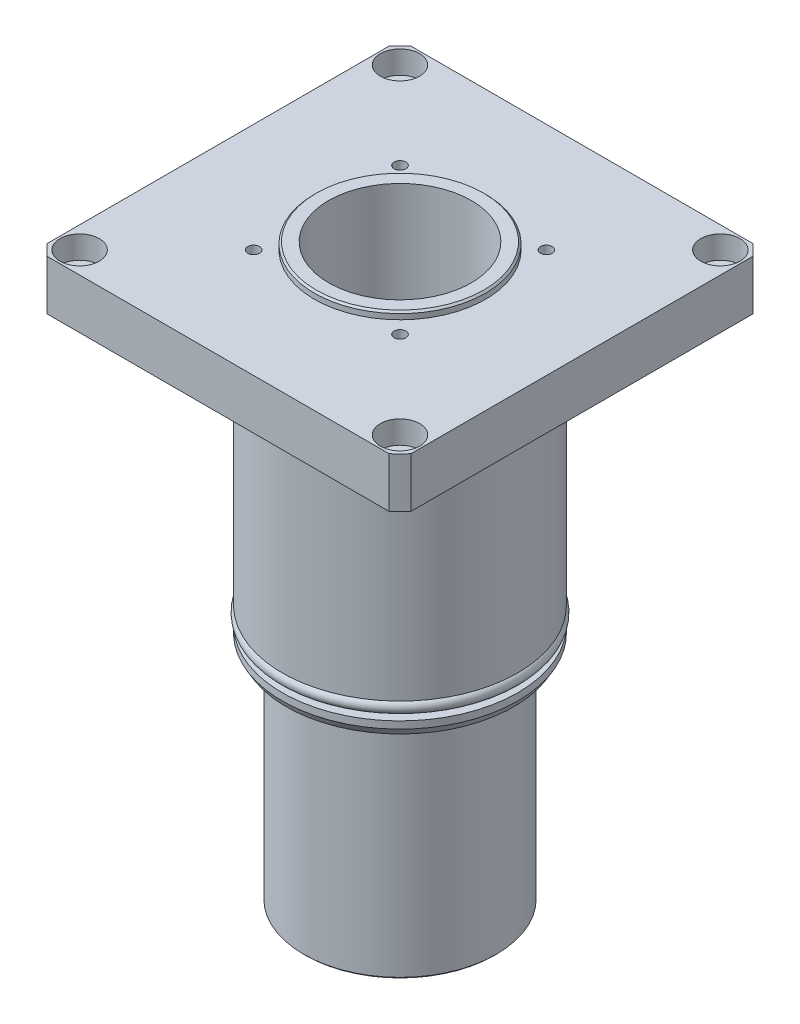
from build123d import *

# Parameters (mm, degrees)
ESQUISSE3_R                                = 1.765
CHANFREIN1_SIZE                            = 0.5
ESQUISSE10_OUTSIDE_W                       = 192.912
ESQUISSE10_OUTSIDE_H                       = 192.912
ESQUISSE10_OUTSIDE_W_2                     = 102
ESQUISSE10_OUTSIDE_H_2                     = 102
ENL_V_MAT_EXTRU_1_DEPTH                    = 30
CHAMBRAGE_POUR_VIS_T_TE_HEXAGONALE_2_COUNT = 2
CHAMBRAGE_POUR_VIS_T_TE_HEXAGONALE_2_PITCH = 89.802561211
CHAMBRAGE_POUR_VIS_T_TE_HEXAGONALE_3_COUNT = 2
CHAMBRAGE_POUR_VIS_T_TE_HEXAGONALE_3_PITCH = 127
CHAMBRAGE_POUR_VIS_T_TE_HEXAGONALE_4_COUNT = 2
CHAMBRAGE_POUR_VIS_T_TE_HEXAGONALE_4_PITCH = 89.802561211
CHANFREIN2_SIZE                            = 0.5
R_P_TITION_CIRCULAIRE1_COUNT               = 4


with BuildPart() as part:
    # Esquisse1 → R_volution1 (revolve)
    with BuildSketch(Plane.XY, mode=Mode.PRIVATE) as r_volution1_sk:
        Polygon((20, 97), (20, -60.802018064), (20.8, -63), (27, -63), (27, 0), (31.845299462, 0), (33, 2), (33, 4), (30, 4), (30, 8.8), (33, 8.8), (33, 65.370834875), (36.25, 71), (36.25, 81), (70, 81), (70, 95), (24, 95), (24, 97), align=None)
    revolve(r_volution1_sk.sketch.rotate(Axis((0, 129.496151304, 0), (0, -1, 0)), 180), axis=Axis((0, 129.496151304, 0), (0, -1, 0)))

    # Chanfrein1
    chanfrein1_edges = [part.edges().sort_by_distance(p)[0] for p in [
        (27, -63, 0),
    ]]
    chamfer(chanfrein1_edges, length=CHANFREIN1_SIZE)

    # Esquisse10 outside → Enl_v. mat.-Extru.1 (cut)
    with BuildSketch(Plane(origin=(0, 95, 0), x_dir=(1, 0, 0), z_dir=(0, 1, 0))):
        Rectangle(ESQUISSE10_OUTSIDE_W, ESQUISSE10_OUTSIDE_H)
        Rectangle(ESQUISSE10_OUTSIDE_W_2, ESQUISSE10_OUTSIDE_H_2, mode=Mode.SUBTRACT)
    extrude(amount=-ENL_V_MAT_EXTRU_1_DEPTH, mode=Mode.SUBTRACT)

    # Esquisse11 → Chambrage pour vis _ t_te hexagonale M61 (revolve, cut)
    with BuildSketch(Plane(origin=(-44.901280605, 95, 44.901280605), x_dir=(0, 0, 1), z_dir=(1, 0, 0))):
        Polygon((0, 0), (0, 158), (3.3, 158), (3.3, 6.4), (5.5, 6.4), (5.5, 0), align=None)
    chambrage_pour_vis_t_te_hexagonale_m61 = revolve(axis=Axis((-44.901280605, 101.35, 44.901280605), (0, -1, 0)), mode=Mode.SUBTRACT)

    # Chambrage pour vis _ t_te hexagonale 2: Chambrage pour vis _ t_te hexagonale M61 ×2
    with Locations(*[(0, 0, -i * CHAMBRAGE_POUR_VIS_T_TE_HEXAGONALE_2_PITCH) for i in range(1, CHAMBRAGE_POUR_VIS_T_TE_HEXAGONALE_2_COUNT)]):
        add(chambrage_pour_vis_t_te_hexagonale_m61, mode=Mode.SUBTRACT)

    # Chambrage pour vis _ t_te hexagonale 3: Chambrage pour vis _ t_te hexagonale M61 ×2
    with Locations(*[Vector(0.7071067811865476, 0, -0.7071067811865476) * (i * CHAMBRAGE_POUR_VIS_T_TE_HEXAGONALE_3_PITCH) for i in range(1, CHAMBRAGE_POUR_VIS_T_TE_HEXAGONALE_3_COUNT)]):
        add(chambrage_pour_vis_t_te_hexagonale_m61, mode=Mode.SUBTRACT)

    # Chambrage pour vis _ t_te hexagonale 4: Chambrage pour vis _ t_te hexagonale M61 ×2
    with Locations(*[(i * CHAMBRAGE_POUR_VIS_T_TE_HEXAGONALE_4_PITCH, 0, 0) for i in range(1, CHAMBRAGE_POUR_VIS_T_TE_HEXAGONALE_4_COUNT)]):
        add(chambrage_pour_vis_t_te_hexagonale_m61, mode=Mode.SUBTRACT)

    # Chanfrein2
    chanfrein2_edges = [part.edges().sort_by_distance(p)[0] for p in [
        (24, 97, 0),
    ]]
    chamfer(chanfrein2_edges, length=CHANFREIN2_SIZE)

    # Esquisse13 → Trou taraud_ M41 (revolve, cut)
    with BuildSketch(Plane(origin=(20.506096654, 95, -20.506096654), x_dir=(0, 0, 1), z_dir=(1, 0, 0))):
        Polygon((0, 0), (0, 12.491420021), (1.65, 11.5), (1.65, 0), align=None)
    trou_taraud_m41 = revolve(axis=Axis((20.506096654, 101.35, -20.506096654), (0, -1, 0)), mode=Mode.SUBTRACT)

    # R_p_tition circulaire1: Trou taraud_ M41 ×4 about axis
    r_p_tition_circulaire1_axis = Axis((0, 0, 0), (0, 1, 0))
    for i in range(1, R_P_TITION_CIRCULAIRE1_COUNT):
        add(trou_taraud_m41.rotate(r_p_tition_circulaire1_axis, i * 360 / R_P_TITION_CIRCULAIRE1_COUNT), mode=Mode.SUBTRACT)


with BuildPart() as body_2:
    # Esquisse3 → R_volution2 (revolve)
    with BuildSketch(Plane.XY, mode=Mode.PRIVATE) as r_volution2_sk:
        with Locations((31.725, 7.035)):
            Circle(ESQUISSE3_R)
    revolve(r_volution2_sk.sketch.rotate(Axis((0, 129.496151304, 0), (0, -1, 0)), 180), axis=Axis((0, 129.496151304, 0), (0, -1, 0)))


solid = Compound([part.part, body_2.part])
